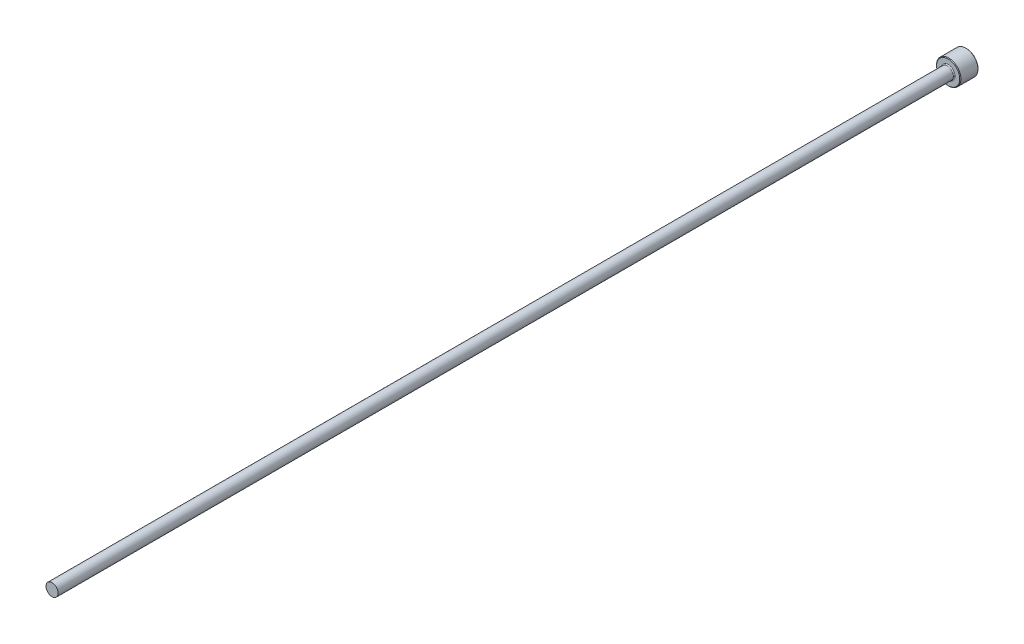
from build123d import *

# Parameters (mm, degrees)
CHAMFER1_SIZE = 0.2


with BuildPart() as part:
    # Sketch1 → Revolve1 (revolve)
    with BuildSketch(Plane(origin=(0, 0, 0), x_dir=(0, 0, -1), z_dir=(1, 0, 0)), mode=Mode.PRIVATE) as revolve1_sk:
        with BuildLine():
            Line((0, 0), (0, 4))
            Line((0, 4), (-6, 4))
            Line((-6, 4), (-6, 2.3))
            ThreePointArc((-6, 2.3), (-6.087867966, 2.087867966), (-6.3, 2))
            Line((-6.3, 2), (-300, 2))
            Line((-300, 2), (-300, 0))
            Line((-300, 0), (0, 0))
        make_face()
    revolve(revolve1_sk.sketch.rotate(Axis((0, 0, 109.05062828), (0, 0, -1)), 90), axis=Axis((0, 0, 109.05062828), (0, 0, -1)))

    # Chamfer1
    chamfer1_edges = [part.edges().sort_by_distance(p)[0] for p in [
        (-4, 0, 0),
        (-4, 0, 6),
    ]]
    chamfer(chamfer1_edges, length=CHAMFER1_SIZE)


solid = part.part
